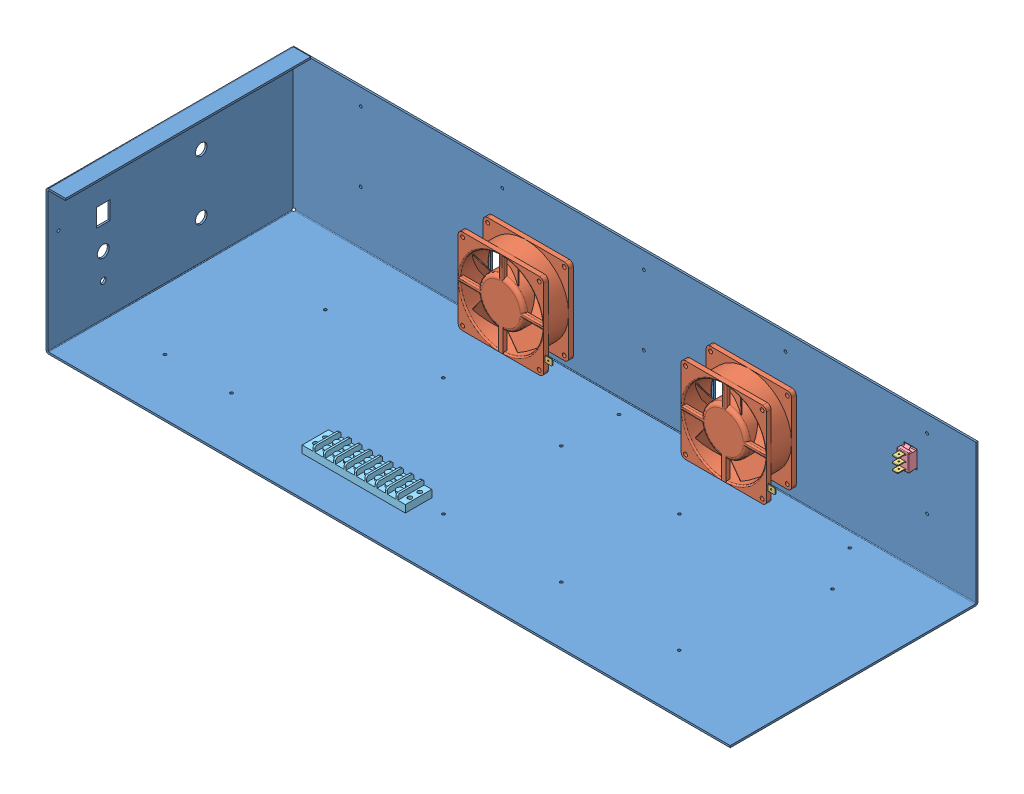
SolidWorks assembly Clip_Lab.SLDASM, configuration Default (file format 13000). Lengths in mm.
Overall size (736.6 154.43 273.21).
13 component instances, 5 part files, 12 mates.
Components (placement in the parent):
- generic_enclosure-1: generic_enclosure.SLDPRT [Default] at origin size (736.6 154.43 266.72)
- FAN-1: FAN.SLDASM [Default] at (174.512 -3.3891 -442.2279) size (105.02 92.14 32.23)
  - FAN_w_CONN-1: FAN_w_CONN.SLDPRT [Default] at (-298.512 61.4211 233.7599) size (97.22 92.14 32.23)
  - Slide_Clip_Male-1: Slide_Clip_Male.SLDPRT [Default] at (-249.112 31.9883 237.1425) x (0 1 0) z (1 0 0) size (7.92 0.81 14.02)
- FAN-2: FAN.SLDASM [Default] at (414.512 -3.3891 -442.2279) size (105.02 92.14 32.23)
  - FAN_w_CONN-1: FAN_w_CONN.SLDPRT [Default] at (-298.512 61.4211 233.7599) size (97.22 92.14 32.23)
  - Slide_Clip_Male-1: Slide_Clip_Male.SLDPRT [Default] at (-249.112 31.9883 237.1425) x (0 1 0) z (1 0 0) size (7.92 0.81 14.02)
- SWITCH-2: SWITCH.SLDASM [Default] at (280.797 105.2322 -239.532) x (-1 0 0) z (0 0 -1) size (15.01 23.42 25.66)
  - SWITCH-3 PRONGS-1: SWITCH-3 PRONGS.SLDPRT [Default] at origin size (15.01 23.42 17.74)
  - Slide_Clip_Male-1: Slide_Clip_Male.SLDPRT [Default] at (-4.318 -6.556 -16.6842) x (-1 0 0) z (0 0 -1) size (7.92 0.81 14.02)
  - Slide_Clip_Male-2: Slide_Clip_Male.SLDPRT [Default] at (-4.318 0.4544 -16.6842) x (-1 0 0) z (0 0 -1) size (7.92 0.81 14.02)
  - Slide_Clip_Male-4: Slide_Clip_Male.SLDPRT [Default] at (-4.318 7.2108 -16.6842) x (-1 0 0) z (0 0 -1) size (7.92 0.81 14.02)
- Terminal Block-1: Terminal Block.SLDPRT [Default] at (-36.068 2.032 -41.158) x (-1 0 0) z (0 1 0) size (111.12 28.45 13.46)
Mates (geometry in assembly coordinates):
- Coincident1: coincident: plane of generic_enclosure-1 through (-381 152.4 -235.468) normal (0 0 1); plane of FAN-1/FAN_w_CONN-1 through (-170 104.032 -235.468) normal (0 0 -1)
- Concentric1: concentric: cylinder of generic_enclosure-1 through (-82.75 16.782 -237.5) axis (0 0 1) radius 2.15; cylinder of FAN-1/FAN_w_CONN-1 through (-82.75 16.782 -203.468) axis (0 0 -1) radius 2.15
- Concentric2: concentric: cylinder of generic_enclosure-1 through (-82.75 99.282 -237.5) axis (0 0 1) radius 2.15; cylinder of FAN-1/FAN_w_CONN-1 through (-82.75 99.282 -203.468) axis (0 0 -1) radius 2.15
- Coincident6: coincident: plane of generic_enclosure-1 through (-381 152.4 -235.468) normal (0 0 1); plane of FAN-2/FAN_w_CONN-1 through (70 104.032 -235.468) normal (0 0 -1)
- Concentric3: concentric: cylinder of generic_enclosure-1 through (157.25 16.782 -237.5) axis (0 0 1) radius 2.15; cylinder of FAN-2/FAN_w_CONN-1 through (157.25 16.782 -203.468) axis (0 0 -1) radius 2.15
- Concentric4: concentric: cylinder of generic_enclosure-1 through (157.25 99.282 -237.5) axis (0 0 1) radius 2.15; cylinder of FAN-2/FAN_w_CONN-1 through (157.25 99.282 -203.468) axis (0 0 -1) radius 2.15
- Coincident112: coincident: plane of generic_enclosure-1 through (-381 152.4 -237.5) normal (0 0 -1); plane of SWITCH-2/SWITCH-3 PRONGS-1 through (293.2557 94.8182 -237.5) normal (0 0 1)
- Coincident113: coincident: plane of generic_enclosure-1 through (277.876 114.3 -237.5) normal (0 -1 0); plane of SWITCH-2/SWITCH-3 PRONGS-1 through (293.2557 114.3 -235.0616) normal (0 1 0)
- Coincident114: coincident: plane of generic_enclosure-1 through (292.1 114.3 -237.5) normal (-1 0 0); plane of SWITCH-2/SWITCH-3 PRONGS-1 through (292.1 95.9612 -226.2478) normal (1 0 0)
- Coincident115: coincident: plane of generic_enclosure-1 through (-381 2.032 237.5) normal (0 1 0); plane of Terminal Block-1 through (-147.193 2.032 -41.158) normal (0 -1 0)
- Concentric5: concentric: cylinder of Terminal Block-1 through (-141.732 2.032 -32.268) axis (0 1 0) radius 2.286; cylinder of generic_enclosure-1 through (-141.732 -4.3105 -32.268) axis (0 1 0) radius 1.524
- Parallel1: parallel: plane of generic_enclosure-1 through (0 0 29.22) normal (0 0 1); plane of Terminal Block-1 through (-36.068 2.032 -12.71) normal (0 0 1)
